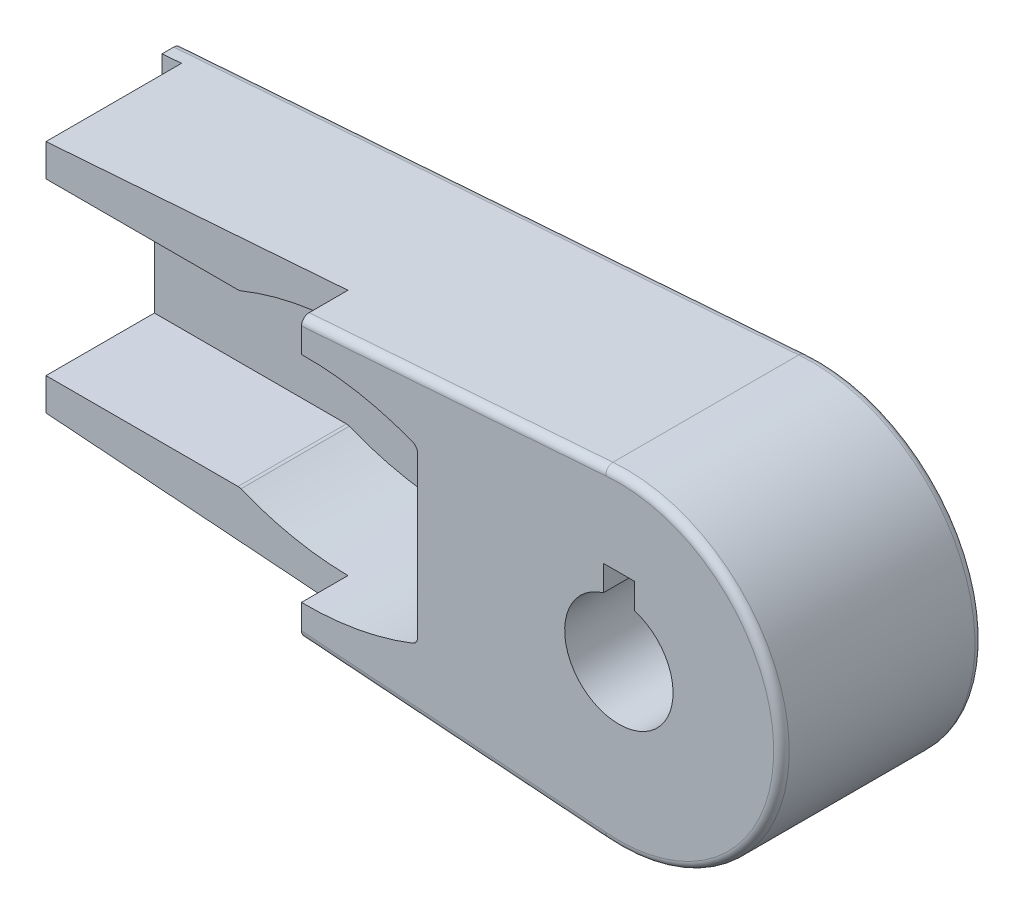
ISO-10303-21;
HEADER;
FILE_DESCRIPTION(('STEP AP214'),'2;1');
FILE_NAME('part.step','',(''),(''),'','','');
FILE_SCHEMA(('AUTOMOTIVE_DESIGN { 1 0 10303 214 1 1 1 1 }'));
ENDSEC;
DATA;
#1=APPLICATION_CONTEXT('core data for automotive mechanical design processes');
#2=APPLICATION_PROTOCOL_DEFINITION('international standard','automotive_design',2000,#1);
#3=PRODUCT_CONTEXT('',#1,'mechanical');
#4=PRODUCT('Part','Part','',(#3));
#5=PRODUCT_RELATED_PRODUCT_CATEGORY('part','',(#4));
#6=PRODUCT_DEFINITION_FORMATION('','',#4);
#7=PRODUCT_DEFINITION_CONTEXT('part definition',#1,'design');
#8=PRODUCT_DEFINITION('design','',#6,#7);
#9=PRODUCT_DEFINITION_SHAPE('','',#8);
#10=(LENGTH_UNIT() NAMED_UNIT(*) SI_UNIT(.MILLI.,.METRE.));
#11=(NAMED_UNIT(*) PLANE_ANGLE_UNIT() SI_UNIT($,.RADIAN.));
#12=(NAMED_UNIT(*) SI_UNIT($,.STERADIAN.) SOLID_ANGLE_UNIT());
#13=UNCERTAINTY_MEASURE_WITH_UNIT(LENGTH_MEASURE(1.E-05),#10,'distance_accuracy_value','');
#14=(GEOMETRIC_REPRESENTATION_CONTEXT(3) GLOBAL_UNCERTAINTY_ASSIGNED_CONTEXT((#13)) GLOBAL_UNIT_ASSIGNED_CONTEXT((#10,
#11,#12)) REPRESENTATION_CONTEXT('',''));
#15=CARTESIAN_POINT('',(0.,0.,0.));
#16=DIRECTION('',(0.,0.,1.));
#17=DIRECTION('',(1.,0.,0.));
#18=AXIS2_PLACEMENT_3D('',#15,#16,#17);
#19=CARTESIAN_POINT('',(-165.,-22.,-40.));
#20=DIRECTION('',(0.,-1.,0.));
#21=DIRECTION('',(0.,0.,-1.));
#22=AXIS2_PLACEMENT_3D('',#19,#20,#21);
#23=PLANE('',#22);
#24=DIRECTION('',(-1.,0.,0.));
#25=VECTOR('',#24,1.);
#26=CARTESIAN_POINT('',(-165.,-22.,-12.));
#27=LINE('',#26,#25);
#28=CARTESIAN_POINT('',(-110.393907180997,-22.,-12.));
#29=VERTEX_POINT('',#28);
#30=CARTESIAN_POINT('',(-160.,-22.,-12.));
#31=VERTEX_POINT('',#30);
#32=EDGE_CURVE('E267',#29,#31,#27,.T.);
#33=ORIENTED_EDGE('',*,*,#32,.F.);
#34=DIRECTION('',(0.,0.,1.));
#35=VECTOR('',#34,1.);
#36=CARTESIAN_POINT('',(-110.393907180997,-22.,-40.));
#37=LINE('',#36,#35);
#38=CARTESIAN_POINT('',(-110.393907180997,-22.,-40.));
#39=VERTEX_POINT('',#38);
#40=EDGE_CURVE('E413',#29,#39,#37,.F.);
#41=ORIENTED_EDGE('',*,*,#40,.T.);
#42=DIRECTION('',(1.,0.,0.));
#43=VECTOR('',#42,1.);
#44=CARTESIAN_POINT('',(-165.,-22.,-40.));
#45=LINE('',#44,#43);
#46=CARTESIAN_POINT('',(-160.,-22.,-40.));
#47=VERTEX_POINT('',#46);
#48=EDGE_CURVE('E471',#47,#39,#45,.T.);
#49=ORIENTED_EDGE('',*,*,#48,.F.);
#50=DIRECTION('',(0.,0.,-1.));
#51=VECTOR('',#50,1.);
#52=CARTESIAN_POINT('',(-160.,-22.,-40.));
#53=LINE('',#52,#51);
#54=EDGE_CURVE('E400',#31,#47,#53,.T.);
#55=ORIENTED_EDGE('',*,*,#54,.F.);
#56=EDGE_LOOP('',(#33,#41,#49,#55));
#57=FACE_BOUND('',#56,.T.);
#58=ADVANCED_FACE('F31',(#57),#23,.F.);
#59=CARTESIAN_POINT('',(-165.,22.,-40.));
#60=DIRECTION('',(0.,1.,0.));
#61=DIRECTION('',(0.,0.,1.));
#62=AXIS2_PLACEMENT_3D('',#59,#60,#61);
#63=PLANE('',#62);
#64=DIRECTION('',(-1.,0.,0.));
#65=VECTOR('',#64,1.);
#66=CARTESIAN_POINT('',(-165.,22.,-40.));
#67=LINE('',#66,#65);
#68=CARTESIAN_POINT('',(-110.393907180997,22.,-40.));
#69=VERTEX_POINT('',#68);
#70=CARTESIAN_POINT('',(-160.,22.,-40.));
#71=VERTEX_POINT('',#70);
#72=EDGE_CURVE('E469',#69,#71,#67,.T.);
#73=ORIENTED_EDGE('',*,*,#72,.F.);
#74=DIRECTION('',(0.,0.,1.));
#75=VECTOR('',#74,1.);
#76=CARTESIAN_POINT('',(-110.393907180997,22.,-40.));
#77=LINE('',#76,#75);
#78=CARTESIAN_POINT('',(-110.393907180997,22.,-12.));
#79=VERTEX_POINT('',#78);
#80=EDGE_CURVE('E440',#69,#79,#77,.T.);
#81=ORIENTED_EDGE('',*,*,#80,.T.);
#82=DIRECTION('',(1.,0.,0.));
#83=VECTOR('',#82,1.);
#84=CARTESIAN_POINT('',(-165.,22.,-12.));
#85=LINE('',#84,#83);
#86=CARTESIAN_POINT('',(-160.,22.,-12.));
#87=VERTEX_POINT('',#86);
#88=EDGE_CURVE('E265',#87,#79,#85,.T.);
#89=ORIENTED_EDGE('',*,*,#88,.F.);
#90=DIRECTION('',(0.,0.,1.));
#91=VECTOR('',#90,1.);
#92=CARTESIAN_POINT('',(-160.,22.,-40.));
#93=LINE('',#92,#91);
#94=EDGE_CURVE('E227',#71,#87,#93,.T.);
#95=ORIENTED_EDGE('',*,*,#94,.F.);
#96=EDGE_LOOP('',(#73,#81,#89,#95));
#97=FACE_BOUND('',#96,.T.);
#98=ADVANCED_FACE('F347',(#97),#63,.F.);
#99=CARTESIAN_POINT('',(-81.,48.2495551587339,-40.));
#100=DIRECTION('',(0.,0.,-1.));
#101=DIRECTION('',(-1.,0.,0.));
#102=AXIS2_PLACEMENT_3D('',#99,#100,#101);
#103=PLANE('',#102);
#104=CARTESIAN_POINT('',(-81.,48.2495551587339,-40.));
#105=DIRECTION('',(0.,0.,1.));
#106=DIRECTION('',(-1.,0.,0.));
#107=AXIS2_PLACEMENT_3D('',#104,#105,#106);
#108=CIRCLE('',#107,76.);
#109=CARTESIAN_POINT('',(-109.640217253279,-22.1474473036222,-40.));
#110=VERTEX_POINT('',#109);
#111=CARTESIAN_POINT('',(-53.2702702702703,-22.5110418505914,-40.));
#112=VERTEX_POINT('',#111);
#113=EDGE_CURVE('E473',#110,#112,#108,.T.);
#114=ORIENTED_EDGE('',*,*,#113,.T.);
#115=CARTESIAN_POINT('',(-54.0000000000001,-20.6489208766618,-40.));
#116=DIRECTION('',(0.,0.,-1.));
#117=DIRECTION('',(-1.,0.,0.));
#118=AXIS2_PLACEMENT_3D('',#115,#116,#117);
#119=CIRCLE('',#118,2.);
#120=CARTESIAN_POINT('',(-52.,-20.6489208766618,-40.));
#121=VERTEX_POINT('',#120);
#122=EDGE_CURVE('E433',#112,#121,#119,.F.);
#123=ORIENTED_EDGE('',*,*,#122,.T.);
#124=DIRECTION('',(0.,1.,0.));
#125=VECTOR('',#124,1.);
#126=CARTESIAN_POINT('',(-52.,22.,-40.));
#127=LINE('',#126,#125);
#128=CARTESIAN_POINT('',(-52.,20.6489208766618,-40.));
#129=VERTEX_POINT('',#128);
#130=EDGE_CURVE('E468',#121,#129,#127,.T.);
#131=ORIENTED_EDGE('',*,*,#130,.T.);
#132=CARTESIAN_POINT('',(-54.,20.6489208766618,-40.));
#133=DIRECTION('',(0.,0.,-1.));
#134=DIRECTION('',(-1.,0.,0.));
#135=AXIS2_PLACEMENT_3D('',#132,#133,#134);
#136=CIRCLE('',#135,2.);
#137=CARTESIAN_POINT('',(-53.2702702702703,22.5110418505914,-40.));
#138=VERTEX_POINT('',#137);
#139=EDGE_CURVE('E431',#129,#138,#136,.F.);
#140=ORIENTED_EDGE('',*,*,#139,.T.);
#141=CARTESIAN_POINT('',(-81.,-48.2495551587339,-40.));
#142=DIRECTION('',(0.,0.,1.));
#143=DIRECTION('',(1.,0.,0.));
#144=AXIS2_PLACEMENT_3D('',#141,#142,#143);
#145=CIRCLE('',#144,76.);
#146=CARTESIAN_POINT('',(-109.640217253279,22.1474473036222,-40.));
#147=VERTEX_POINT('',#146);
#148=EDGE_CURVE('E466',#138,#147,#145,.T.);
#149=ORIENTED_EDGE('',*,*,#148,.T.);
#150=CARTESIAN_POINT('',(-110.393907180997,24.,-40.));
#151=DIRECTION('',(0.,0.,-1.));
#152=DIRECTION('',(-1.,0.,0.));
#153=AXIS2_PLACEMENT_3D('',#150,#151,#152);
#154=CIRCLE('',#153,2.);
#155=EDGE_CURVE('E11',#147,#69,#154,.T.);
#156=ORIENTED_EDGE('',*,*,#155,.T.);
#157=ORIENTED_EDGE('',*,*,#72,.T.);
#158=DIRECTION('',(0.,1.,0.));
#159=VECTOR('',#158,1.);
#160=CARTESIAN_POINT('',(-160.,48.2495551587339,-40.));
#161=LINE('',#160,#159);
#162=EDGE_CURVE('E226',#47,#71,#161,.T.);
#163=ORIENTED_EDGE('',*,*,#162,.F.);
#164=ORIENTED_EDGE('',*,*,#48,.T.);
#165=CARTESIAN_POINT('',(-110.393907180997,-24.,-40.));
#166=DIRECTION('',(0.,0.,-1.));
#167=DIRECTION('',(-1.,0.,0.));
#168=AXIS2_PLACEMENT_3D('',#165,#166,#167);
#169=CIRCLE('',#168,2.);
#170=EDGE_CURVE('E420',#39,#110,#169,.T.);
#171=ORIENTED_EDGE('',*,*,#170,.T.);
#172=EDGE_LOOP('',(#114,#123,#131,#140,#149,#156,#157,#163,#164,#171));
#173=FACE_BOUND('',#172,.T.);
#174=ADVANCED_FACE('F343',(#173),#103,.F.);
#175=CARTESIAN_POINT('',(-163.075800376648,-59.2019774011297,-12.));
#176=DIRECTION('',(0.,0.,1.));
#177=DIRECTION('',(1.,0.,0.));
#178=AXIS2_PLACEMENT_3D('',#175,#176,#177);
#179=PLANE('',#178);
#180=CARTESIAN_POINT('',(-81.,48.2495551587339,-12.));
#181=DIRECTION('',(0.,0.,1.));
#182=DIRECTION('',(1.,0.,0.));
#183=AXIS2_PLACEMENT_3D('',#180,#181,#182);
#184=CIRCLE('',#183,76.);
#185=CARTESIAN_POINT('',(-82.,-27.7438656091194,-12.));
#186=VERTEX_POINT('',#185);
#187=CARTESIAN_POINT('',(-109.640217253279,-22.1474473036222,-12.));
#188=VERTEX_POINT('',#187);
#189=EDGE_CURVE('E269',#186,#188,#184,.F.);
#190=ORIENTED_EDGE('',*,*,#189,.T.);
#191=CARTESIAN_POINT('',(-110.393907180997,-24.,-12.));
#192=DIRECTION('',(0.,0.,1.));
#193=DIRECTION('',(1.,0.,0.));
#194=AXIS2_PLACEMENT_3D('',#191,#192,#193);
#195=CIRCLE('',#194,2.);
#196=EDGE_CURVE('E410',#188,#29,#195,.T.);
#197=ORIENTED_EDGE('',*,*,#196,.T.);
#198=ORIENTED_EDGE('',*,*,#32,.T.);
#199=DIRECTION('',(0.,-1.,0.));
#200=VECTOR('',#199,1.);
#201=CARTESIAN_POINT('',(-160.,-59.2019774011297,-12.));
#202=LINE('',#201,#200);
#203=CARTESIAN_POINT('',(-160.,-30.3669851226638,-12.));
#204=VERTEX_POINT('',#203);
#205=EDGE_CURVE('E402',#31,#204,#202,.T.);
#206=ORIENTED_EDGE('',*,*,#205,.T.);
#207=DIRECTION('',(-0.997317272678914,0.0732001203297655,0.));
#208=VECTOR('',#207,1.);
#209=CARTESIAN_POINT('',(-165.,-30.,-12.));
#210=LINE('',#209,#208);
#211=CARTESIAN_POINT('',(-82.,-36.0919530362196,-12.));
#212=VERTEX_POINT('',#211);
#213=EDGE_CURVE('E272',#212,#204,#210,.T.);
#214=ORIENTED_EDGE('',*,*,#213,.F.);
#215=DIRECTION('',(0.,1.,0.));
#216=VECTOR('',#215,1.);
#217=CARTESIAN_POINT('',(-82.,52.7824858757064,-12.));
#218=LINE('',#217,#216);
#219=EDGE_CURVE('E251',#212,#186,#218,.T.);
#220=ORIENTED_EDGE('',*,*,#219,.T.);
#221=EDGE_LOOP('',(#190,#197,#198,#206,#214,#220));
#222=FACE_BOUND('',#221,.T.);
#223=ADVANCED_FACE('F346',(#222),#179,.T.);
#224=ORIENTED_EDGE('',*,*,#88,.T.);
#225=CARTESIAN_POINT('',(-110.393907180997,24.,-12.));
#226=DIRECTION('',(0.,0.,1.));
#227=DIRECTION('',(1.,0.,0.));
#228=AXIS2_PLACEMENT_3D('',#225,#226,#227);
#229=CIRCLE('',#228,2.);
#230=CARTESIAN_POINT('',(-109.640217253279,22.1474473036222,-12.));
#231=VERTEX_POINT('',#230);
#232=EDGE_CURVE('E46',#79,#231,#229,.T.);
#233=ORIENTED_EDGE('',*,*,#232,.T.);
#234=CARTESIAN_POINT('',(-81.,-48.2495551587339,-12.));
#235=DIRECTION('',(0.,0.,1.));
#236=DIRECTION('',(1.,0.,0.));
#237=AXIS2_PLACEMENT_3D('',#234,#235,#236);
#238=CIRCLE('',#237,76.);
#239=CARTESIAN_POINT('',(-82.,27.7438656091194,-12.));
#240=VERTEX_POINT('',#239);
#241=EDGE_CURVE('E528',#231,#240,#238,.F.);
#242=ORIENTED_EDGE('',*,*,#241,.T.);
#243=CARTESIAN_POINT('',(-82.,36.0919530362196,-12.));
#244=VERTEX_POINT('',#243);
#245=EDGE_CURVE('E248',#240,#244,#218,.T.);
#246=ORIENTED_EDGE('',*,*,#245,.T.);
#247=DIRECTION('',(0.997317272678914,0.0732001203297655,0.));
#248=VECTOR('',#247,1.);
#249=CARTESIAN_POINT('',(-165.,30.,-12.));
#250=LINE('',#249,#248);
#251=CARTESIAN_POINT('',(-160.,30.3669851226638,-12.));
#252=VERTEX_POINT('',#251);
#253=EDGE_CURVE('E275',#252,#244,#250,.T.);
#254=ORIENTED_EDGE('',*,*,#253,.F.);
#255=DIRECTION('',(0.,-1.,0.));
#256=VECTOR('',#255,1.);
#257=CARTESIAN_POINT('',(-160.,-59.2019774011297,-12.));
#258=LINE('',#257,#256);
#259=EDGE_CURVE('E222',#252,#87,#258,.T.);
#260=ORIENTED_EDGE('',*,*,#259,.T.);
#261=EDGE_LOOP('',(#224,#233,#242,#246,#254,#260));
#262=FACE_BOUND('',#261,.T.);
#263=ADVANCED_FACE('F554',(#262),#179,.T.);
#264=CARTESIAN_POINT('',(-165.,30.,-52.));
#265=DIRECTION('',(-0.0732001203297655,0.997317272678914,0.));
#266=DIRECTION('',(-0.997317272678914,-0.0732001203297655,0.));
#267=AXIS2_PLACEMENT_3D('',#264,#265,#266);
#268=PLANE('',#267);
#269=DIRECTION('',(-0.997317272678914,-0.0732001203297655,0.));
#270=VECTOR('',#269,1.);
#271=CARTESIAN_POINT('',(-165.,30.,-47.));
#272=LINE('',#271,#270);
#273=CARTESIAN_POINT('',(-160.,30.3669851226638,-47.));
#274=VERTEX_POINT('',#273);
#275=CARTESIAN_POINT('',(-165.,30.,-47.));
#276=VERTEX_POINT('',#275);
#277=EDGE_CURVE('E231',#274,#276,#272,.T.);
#278=ORIENTED_EDGE('',*,*,#277,.F.);
#279=DIRECTION('',(0.,0.,1.));
#280=VECTOR('',#279,1.);
#281=CARTESIAN_POINT('',(-160.,30.3669851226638,-52.));
#282=LINE('',#281,#280);
#283=EDGE_CURVE('E215',#274,#252,#282,.T.);
#284=ORIENTED_EDGE('',*,*,#283,.T.);
#285=ORIENTED_EDGE('',*,*,#253,.T.);
#286=DIRECTION('',(0.,0.,-1.));
#287=VECTOR('',#286,1.);
#288=CARTESIAN_POINT('',(-82.,36.0919530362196,-52.));
#289=LINE('',#288,#287);
#290=CARTESIAN_POINT('',(-82.,36.0919530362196,-2.));
#291=VERTEX_POINT('',#290);
#292=EDGE_CURVE('E256',#291,#244,#289,.T.);
#293=ORIENTED_EDGE('',*,*,#292,.F.);
#294=DIRECTION('',(-0.997317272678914,-0.0732001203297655,0.));
#295=VECTOR('',#294,1.);
#296=CARTESIAN_POINT('',(-165.,30.,-2.));
#297=LINE('',#296,#295);
#298=CARTESIAN_POINT('',(-3.52775646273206,41.8515822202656,-2.00000000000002));
#299=VERTEX_POINT('',#298);
#300=EDGE_CURVE('E515',#291,#299,#297,.F.);
#301=ORIENTED_EDGE('',*,*,#300,.T.);
#302=DIRECTION('',(0.,0.,1.));
#303=VECTOR('',#302,1.);
#304=CARTESIAN_POINT('',(-3.52775646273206,41.8515822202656,-52.));
#305=LINE('',#304,#303);
#306=CARTESIAN_POINT('',(-3.52775646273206,41.8515822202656,-50.));
#307=VERTEX_POINT('',#306);
#308=EDGE_CURVE('E487',#307,#299,#305,.T.);
#309=ORIENTED_EDGE('',*,*,#308,.F.);
#310=DIRECTION('',(-0.997317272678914,-0.0732001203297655,0.));
#311=VECTOR('',#310,1.);
#312=CARTESIAN_POINT('',(-165.,30.,-50.));
#313=LINE('',#312,#311);
#314=CARTESIAN_POINT('',(-165.,30.,-50.));
#315=VERTEX_POINT('',#314);
#316=EDGE_CURVE('E517',#307,#315,#313,.T.);
#317=ORIENTED_EDGE('',*,*,#316,.T.);
#318=DIRECTION('',(0.,0.,1.));
#319=VECTOR('',#318,1.);
#320=CARTESIAN_POINT('',(-165.,30.,-52.));
#321=LINE('',#320,#319);
#322=EDGE_CURVE('E239',#315,#276,#321,.T.);
#323=ORIENTED_EDGE('',*,*,#322,.T.);
#324=EDGE_LOOP('',(#278,#284,#285,#293,#301,#309,#317,#323));
#325=FACE_BOUND('',#324,.T.);
#326=ADVANCED_FACE('F33',(#325),#268,.T.);
#327=CARTESIAN_POINT('',(0.,0.,-52.));
#328=DIRECTION('',(0.,0.,1.));
#329=DIRECTION('',(1.,0.,0.));
#330=AXIS2_PLACEMENT_3D('',#327,#328,#329);
#331=CYLINDRICAL_SURFACE('',#330,42.);
#332=DIRECTION('',(0.,0.,1.));
#333=VECTOR('',#332,1.);
#334=CARTESIAN_POINT('',(-3.52775646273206,-41.8515822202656,-52.));
#335=LINE('',#334,#333);
#336=CARTESIAN_POINT('',(-3.52775646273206,-41.8515822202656,-50.));
#337=VERTEX_POINT('',#336);
#338=CARTESIAN_POINT('',(-3.52775646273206,-41.8515822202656,-2.00000000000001));
#339=VERTEX_POINT('',#338);
#340=EDGE_CURVE('E491',#337,#339,#335,.T.);
#341=ORIENTED_EDGE('',*,*,#340,.F.);
#342=CARTESIAN_POINT('',(0.,0.,-50.));
#343=DIRECTION('',(0.,0.,1.));
#344=DIRECTION('',(1.,0.,0.));
#345=AXIS2_PLACEMENT_3D('',#342,#343,#344);
#346=CIRCLE('',#345,42.);
#347=EDGE_CURVE('E513',#337,#307,#346,.T.);
#348=ORIENTED_EDGE('',*,*,#347,.T.);
#349=ORIENTED_EDGE('',*,*,#308,.T.);
#350=CARTESIAN_POINT('',(0.,0.,-2.));
#351=DIRECTION('',(0.,0.,1.));
#352=DIRECTION('',(1.,0.,0.));
#353=AXIS2_PLACEMENT_3D('',#350,#351,#352);
#354=CIRCLE('',#353,42.);
#355=EDGE_CURVE('E511',#299,#339,#354,.F.);
#356=ORIENTED_EDGE('',*,*,#355,.T.);
#357=EDGE_LOOP('',(#341,#348,#349,#356));
#358=FACE_BOUND('',#357,.T.);
#359=ADVANCED_FACE('F379',(#358),#331,.T.);
#360=CARTESIAN_POINT('',(-165.,-30.,-52.));
#361=DIRECTION('',(-0.0732001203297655,-0.997317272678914,0.));
#362=DIRECTION('',(0.997317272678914,-0.0732001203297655,0.));
#363=AXIS2_PLACEMENT_3D('',#360,#361,#362);
#364=PLANE('',#363);
#365=DIRECTION('',(0.997317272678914,-0.0732001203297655,0.));
#366=VECTOR('',#365,1.);
#367=CARTESIAN_POINT('',(-165.,-30.,-47.));
#368=LINE('',#367,#366);
#369=CARTESIAN_POINT('',(-165.,-30.,-47.));
#370=VERTEX_POINT('',#369);
#371=CARTESIAN_POINT('',(-160.,-30.3669851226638,-47.));
#372=VERTEX_POINT('',#371);
#373=EDGE_CURVE('E234',#370,#372,#368,.T.);
#374=ORIENTED_EDGE('',*,*,#373,.F.);
#375=DIRECTION('',(0.,0.,1.));
#376=VECTOR('',#375,1.);
#377=CARTESIAN_POINT('',(-165.,-30.,-52.));
#378=LINE('',#377,#376);
#379=CARTESIAN_POINT('',(-165.,-30.,-50.));
#380=VERTEX_POINT('',#379);
#381=EDGE_CURVE('E394',#380,#370,#378,.T.);
#382=ORIENTED_EDGE('',*,*,#381,.F.);
#383=DIRECTION('',(0.997317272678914,-0.0732001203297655,0.));
#384=VECTOR('',#383,1.);
#385=CARTESIAN_POINT('',(-3.527756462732,-41.8515822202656,-50.));
#386=LINE('',#385,#384);
#387=EDGE_CURVE('E498',#380,#337,#386,.T.);
#388=ORIENTED_EDGE('',*,*,#387,.T.);
#389=ORIENTED_EDGE('',*,*,#340,.T.);
#390=DIRECTION('',(0.997317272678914,-0.0732001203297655,0.));
#391=VECTOR('',#390,1.);
#392=CARTESIAN_POINT('',(-165.,-30.,-2.));
#393=LINE('',#392,#391);
#394=CARTESIAN_POINT('',(-82.,-36.0919530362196,-2.));
#395=VERTEX_POINT('',#394);
#396=EDGE_CURVE('E490',#339,#395,#393,.F.);
#397=ORIENTED_EDGE('',*,*,#396,.T.);
#398=DIRECTION('',(0.,0.,1.));
#399=VECTOR('',#398,1.);
#400=CARTESIAN_POINT('',(-82.,-36.0919530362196,-52.));
#401=LINE('',#400,#399);
#402=EDGE_CURVE('E252',#212,#395,#401,.T.);
#403=ORIENTED_EDGE('',*,*,#402,.F.);
#404=ORIENTED_EDGE('',*,*,#213,.T.);
#405=DIRECTION('',(0.,0.,-1.));
#406=VECTOR('',#405,1.);
#407=CARTESIAN_POINT('',(-160.,-30.3669851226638,-52.));
#408=LINE('',#407,#406);
#409=EDGE_CURVE('E244',#204,#372,#408,.T.);
#410=ORIENTED_EDGE('',*,*,#409,.T.);
#411=EDGE_LOOP('',(#374,#382,#388,#389,#397,#403,#404,#410));
#412=FACE_BOUND('',#411,.T.);
#413=ADVANCED_FACE('F382',(#412),#364,.T.);
#414=CARTESIAN_POINT('',(-165.,30.,-52.));
#415=DIRECTION('',(-1.,0.,0.));
#416=DIRECTION('',(0.,0.,1.));
#417=AXIS2_PLACEMENT_3D('',#414,#415,#416);
#418=PLANE('',#417);
#419=DIRECTION('',(0.,-1.,0.));
#420=VECTOR('',#419,1.);
#421=CARTESIAN_POINT('',(-165.,34.8022598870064,-47.));
#422=LINE('',#421,#420);
#423=EDGE_CURVE('E235',#276,#370,#422,.T.);
#424=ORIENTED_EDGE('',*,*,#423,.F.);
#425=ORIENTED_EDGE('',*,*,#322,.F.);
#426=CARTESIAN_POINT('',(-165.,27.9946201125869,-50.));
#427=DIRECTION('',(-1.,0.,0.));
#428=DIRECTION('',(0.,1.,0.));
#429=AXIS2_PLACEMENT_3D('',#426,#427,#428);
#430=ELLIPSE('',#429,2.00537988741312,2.);
#431=CARTESIAN_POINT('',(-165.,27.9946201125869,-52.));
#432=VERTEX_POINT('',#431);
#433=EDGE_CURVE('E507',#315,#432,#430,.T.);
#434=ORIENTED_EDGE('',*,*,#433,.T.);
#435=DIRECTION('',(0.,-1.,0.));
#436=VECTOR('',#435,1.);
#437=CARTESIAN_POINT('',(-165.,30.,-52.));
#438=LINE('',#437,#436);
#439=CARTESIAN_POINT('',(-165.,-27.9946201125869,-52.));
#440=VERTEX_POINT('',#439);
#441=EDGE_CURVE('E484',#432,#440,#438,.T.);
#442=ORIENTED_EDGE('',*,*,#441,.T.);
#443=CARTESIAN_POINT('',(-165.,-27.9946201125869,-50.));
#444=DIRECTION('',(-1.,0.,0.));
#445=DIRECTION('',(0.,1.,0.));
#446=AXIS2_PLACEMENT_3D('',#443,#444,#445);
#447=ELLIPSE('',#446,2.00537988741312,2.);
#448=EDGE_CURVE('E509',#440,#380,#447,.T.);
#449=ORIENTED_EDGE('',*,*,#448,.T.);
#450=ORIENTED_EDGE('',*,*,#381,.T.);
#451=EDGE_LOOP('',(#424,#425,#434,#442,#449,#450));
#452=FACE_BOUND('',#451,.T.);
#453=ADVANCED_FACE('F377',(#452),#418,.T.);
#454=CARTESIAN_POINT('',(0.,0.,-52.));
#455=DIRECTION('',(0.,0.,1.));
#456=DIRECTION('',(1.,0.,0.));
#457=AXIS2_PLACEMENT_3D('',#454,#455,#456);
#458=PLANE('',#457);
#459=DIRECTION('',(-1.,0.,0.));
#460=VECTOR('',#459,1.);
#461=CARTESIAN_POINT('',(-4.,20.,-52.));
#462=LINE('',#461,#460);
#463=CARTESIAN_POINT('',(4.,20.,-52.));
#464=VERTEX_POINT('',#463);
#465=CARTESIAN_POINT('',(-4.,20.,-52.));
#466=VERTEX_POINT('',#465);
#467=EDGE_CURVE('E572',#464,#466,#462,.T.);
#468=ORIENTED_EDGE('',*,*,#467,.T.);
#469=DIRECTION('',(0.,-1.,0.));
#470=VECTOR('',#469,1.);
#471=CARTESIAN_POINT('',(-4.,13.4164078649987,-52.));
#472=LINE('',#471,#470);
#473=CARTESIAN_POINT('',(-4.,13.4164078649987,-52.));
#474=VERTEX_POINT('',#473);
#475=EDGE_CURVE('E564',#466,#474,#472,.T.);
#476=ORIENTED_EDGE('',*,*,#475,.T.);
#477=CARTESIAN_POINT('',(0.,0.,-52.));
#478=DIRECTION('',(0.,0.,1.));
#479=DIRECTION('',(1.,0.,0.));
#480=AXIS2_PLACEMENT_3D('',#477,#478,#479);
#481=CIRCLE('',#480,14.);
#482=CARTESIAN_POINT('',(4.,13.4164078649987,-52.));
#483=VERTEX_POINT('',#482);
#484=EDGE_CURVE('E481',#474,#483,#481,.T.);
#485=ORIENTED_EDGE('',*,*,#484,.T.);
#486=DIRECTION('',(0.,1.,0.));
#487=VECTOR('',#486,1.);
#488=CARTESIAN_POINT('',(4.,20.,-52.));
#489=LINE('',#488,#487);
#490=EDGE_CURVE('E575',#483,#464,#489,.T.);
#491=ORIENTED_EDGE('',*,*,#490,.T.);
#492=EDGE_LOOP('',(#468,#476,#485,#491));
#493=FACE_BOUND('',#492,.T.);
#494=CARTESIAN_POINT('',(0.,0.,-52.));
#495=DIRECTION('',(0.,0.,1.));
#496=DIRECTION('',(1.,0.,0.));
#497=AXIS2_PLACEMENT_3D('',#494,#495,#496);
#498=CIRCLE('',#497,40.);
#499=CARTESIAN_POINT('',(-3.37042581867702,39.857749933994,-52.));
#500=VERTEX_POINT('',#499);
#501=CARTESIAN_POINT('',(-3.37042581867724,-39.8577499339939,-52.));
#502=VERTEX_POINT('',#501);
#503=EDGE_CURVE('E503',#500,#502,#498,.F.);
#504=ORIENTED_EDGE('',*,*,#503,.T.);
#505=DIRECTION('',(0.997317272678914,-0.0732001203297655,0.));
#506=VECTOR('',#505,1.);
#507=CARTESIAN_POINT('',(-164.85359975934,-28.0053654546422,-52.));
#508=LINE('',#507,#506);
#509=EDGE_CURVE('E505',#502,#440,#508,.F.);
#510=ORIENTED_EDGE('',*,*,#509,.T.);
#511=ORIENTED_EDGE('',*,*,#441,.F.);
#512=DIRECTION('',(-0.997317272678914,-0.0732001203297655,0.));
#513=VECTOR('',#512,1.);
#514=CARTESIAN_POINT('',(-3.38135622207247,39.8569476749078,-52.));
#515=LINE('',#514,#513);
#516=EDGE_CURVE('E501',#432,#500,#515,.F.);
#517=ORIENTED_EDGE('',*,*,#516,.T.);
#518=EDGE_LOOP('',(#504,#510,#511,#517));
#519=FACE_BOUND('',#518,.T.);
#520=ADVANCED_FACE('F373',(#493,#519),#458,.F.);
#521=CARTESIAN_POINT('',(0.,0.,0.));
#522=DIRECTION('',(0.,0.,1.));
#523=DIRECTION('',(1.,0.,0.));
#524=AXIS2_PLACEMENT_3D('',#521,#522,#523);
#525=PLANE('',#524);
#526=DIRECTION('',(0.,1.,0.));
#527=VECTOR('',#526,1.);
#528=CARTESIAN_POINT('',(-82.,52.7824858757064,0.));
#529=LINE('',#528,#527);
#530=CARTESIAN_POINT('',(-82.,-34.0865731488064,0.));
#531=VERTEX_POINT('',#530);
#532=CARTESIAN_POINT('',(-82.,-27.7438656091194,0.));
#533=VERTEX_POINT('',#532);
#534=EDGE_CURVE('E242',#531,#533,#529,.T.);
#535=ORIENTED_EDGE('',*,*,#534,.F.);
#536=DIRECTION('',(0.997317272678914,-0.0732001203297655,0.));
#537=VECTOR('',#536,1.);
#538=CARTESIAN_POINT('',(-2.92782459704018,-39.8902355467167,0.));
#539=LINE('',#538,#537);
#540=CARTESIAN_POINT('',(-3.3704258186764,-39.857749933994,0.));
#541=VERTEX_POINT('',#540);
#542=EDGE_CURVE('E524',#531,#541,#539,.T.);
#543=ORIENTED_EDGE('',*,*,#542,.T.);
#544=CARTESIAN_POINT('',(0.,0.,0.));
#545=DIRECTION('',(0.,0.,1.));
#546=DIRECTION('',(1.,0.,0.));
#547=AXIS2_PLACEMENT_3D('',#544,#545,#546);
#548=CIRCLE('',#547,40.);
#549=CARTESIAN_POINT('',(-3.37042581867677,39.857749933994,0.));
#550=VERTEX_POINT('',#549);
#551=EDGE_CURVE('E522',#541,#550,#548,.T.);
#552=ORIENTED_EDGE('',*,*,#551,.T.);
#553=DIRECTION('',(-0.997317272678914,-0.0732001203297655,0.));
#554=VECTOR('',#553,1.);
#555=CARTESIAN_POINT('',(-2.92782459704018,39.8902355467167,0.));
#556=LINE('',#555,#554);
#557=CARTESIAN_POINT('',(-82.0000000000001,34.0865731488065,0.));
#558=VERTEX_POINT('',#557);
#559=EDGE_CURVE('E519',#550,#558,#556,.T.);
#560=ORIENTED_EDGE('',*,*,#559,.T.);
#561=CARTESIAN_POINT('',(-82.,27.7438656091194,0.));
#562=VERTEX_POINT('',#561);
#563=EDGE_CURVE('E240',#562,#558,#529,.T.);
#564=ORIENTED_EDGE('',*,*,#563,.F.);
#565=CARTESIAN_POINT('',(-81.,-48.2495551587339,0.));
#566=DIRECTION('',(0.,0.,1.));
#567=DIRECTION('',(1.,0.,0.));
#568=AXIS2_PLACEMENT_3D('',#565,#566,#567);
#569=CIRCLE('',#568,76.);
#570=CARTESIAN_POINT('',(-53.2702702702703,22.5110418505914,0.));
#571=VERTEX_POINT('',#570);
#572=EDGE_CURVE('E452',#571,#562,#569,.T.);
#573=ORIENTED_EDGE('',*,*,#572,.F.);
#574=CARTESIAN_POINT('',(-54.,20.6489208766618,0.));
#575=DIRECTION('',(0.,0.,1.));
#576=DIRECTION('',(1.,0.,0.));
#577=AXIS2_PLACEMENT_3D('',#574,#575,#576);
#578=CIRCLE('',#577,2.);
#579=CARTESIAN_POINT('',(-52.,20.6489208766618,0.));
#580=VERTEX_POINT('',#579);
#581=EDGE_CURVE('E39',#571,#580,#578,.F.);
#582=ORIENTED_EDGE('',*,*,#581,.T.);
#583=DIRECTION('',(0.,1.,0.));
#584=VECTOR('',#583,1.);
#585=CARTESIAN_POINT('',(-52.,22.,0.));
#586=LINE('',#585,#584);
#587=CARTESIAN_POINT('',(-52.,-20.6489208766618,0.));
#588=VERTEX_POINT('',#587);
#589=EDGE_CURVE('E450',#588,#580,#586,.T.);
#590=ORIENTED_EDGE('',*,*,#589,.F.);
#591=CARTESIAN_POINT('',(-54.0000000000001,-20.6489208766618,0.));
#592=DIRECTION('',(0.,0.,1.));
#593=DIRECTION('',(1.,0.,0.));
#594=AXIS2_PLACEMENT_3D('',#591,#592,#593);
#595=CIRCLE('',#594,2.);
#596=CARTESIAN_POINT('',(-53.2702702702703,-22.5110418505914,0.));
#597=VERTEX_POINT('',#596);
#598=EDGE_CURVE('E444',#588,#597,#595,.F.);
#599=ORIENTED_EDGE('',*,*,#598,.T.);
#600=CARTESIAN_POINT('',(-81.,48.2495551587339,0.));
#601=DIRECTION('',(0.,0.,1.));
#602=DIRECTION('',(-1.,0.,0.));
#603=AXIS2_PLACEMENT_3D('',#600,#601,#602);
#604=CIRCLE('',#603,76.);
#605=EDGE_CURVE('E459',#533,#597,#604,.T.);
#606=ORIENTED_EDGE('',*,*,#605,.F.);
#607=EDGE_LOOP('',(#535,#543,#552,#560,#564,#573,#582,#590,#599,#606));
#608=FACE_BOUND('',#607,.T.);
#609=DIRECTION('',(0.,-1.,0.));
#610=VECTOR('',#609,1.);
#611=CARTESIAN_POINT('',(-4.,13.4164078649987,0.));
#612=LINE('',#611,#610);
#613=CARTESIAN_POINT('',(-4.,20.,0.));
#614=VERTEX_POINT('',#613);
#615=CARTESIAN_POINT('',(-4.,13.4164078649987,0.));
#616=VERTEX_POINT('',#615);
#617=EDGE_CURVE('E578',#614,#616,#612,.T.);
#618=ORIENTED_EDGE('',*,*,#617,.F.);
#619=DIRECTION('',(-1.,0.,0.));
#620=VECTOR('',#619,1.);
#621=CARTESIAN_POINT('',(-4.,20.,0.));
#622=LINE('',#621,#620);
#623=CARTESIAN_POINT('',(4.,20.,0.));
#624=VERTEX_POINT('',#623);
#625=EDGE_CURVE('E579',#624,#614,#622,.T.);
#626=ORIENTED_EDGE('',*,*,#625,.F.);
#627=DIRECTION('',(0.,1.,0.));
#628=VECTOR('',#627,1.);
#629=CARTESIAN_POINT('',(4.,20.,0.));
#630=LINE('',#629,#628);
#631=CARTESIAN_POINT('',(4.,13.4164078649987,0.));
#632=VERTEX_POINT('',#631);
#633=EDGE_CURVE('E323',#632,#624,#630,.T.);
#634=ORIENTED_EDGE('',*,*,#633,.F.);
#635=CARTESIAN_POINT('',(0.,0.,0.));
#636=DIRECTION('',(0.,0.,1.));
#637=DIRECTION('',(1.,0.,0.));
#638=AXIS2_PLACEMENT_3D('',#635,#636,#637);
#639=CIRCLE('',#638,14.);
#640=EDGE_CURVE('E478',#616,#632,#639,.T.);
#641=ORIENTED_EDGE('',*,*,#640,.F.);
#642=EDGE_LOOP('',(#618,#626,#634,#641));
#643=FACE_BOUND('',#642,.T.);
#644=ADVANCED_FACE('F369',(#608,#643),#525,.T.);
#645=CARTESIAN_POINT('',(0.,0.,-52.));
#646=DIRECTION('',(0.,0.,1.));
#647=DIRECTION('',(1.,0.,0.));
#648=AXIS2_PLACEMENT_3D('',#645,#646,#647);
#649=CYLINDRICAL_SURFACE('',#648,14.);
#650=ORIENTED_EDGE('',*,*,#484,.F.);
#651=DIRECTION('',(0.,0.,1.));
#652=VECTOR('',#651,1.);
#653=CARTESIAN_POINT('',(-4.,13.4164078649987,-52.));
#654=LINE('',#653,#652);
#655=EDGE_CURVE('E560',#474,#616,#654,.T.);
#656=ORIENTED_EDGE('',*,*,#655,.T.);
#657=ORIENTED_EDGE('',*,*,#640,.T.);
#658=DIRECTION('',(0.,0.,1.));
#659=VECTOR('',#658,1.);
#660=CARTESIAN_POINT('',(4.,13.4164078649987,-52.));
#661=LINE('',#660,#659);
#662=EDGE_CURVE('E561',#483,#632,#661,.T.);
#663=ORIENTED_EDGE('',*,*,#662,.F.);
#664=EDGE_LOOP('',(#650,#656,#657,#663));
#665=FACE_BOUND('',#664,.T.);
#666=ADVANCED_FACE('F365',(#665),#649,.F.);
#667=CARTESIAN_POINT('',(-81.,48.2495551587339,-40.));
#668=DIRECTION('',(0.,0.,1.));
#669=DIRECTION('',(1.,0.,0.));
#670=AXIS2_PLACEMENT_3D('',#667,#668,#669);
#671=CYLINDRICAL_SURFACE('',#670,76.);
#672=ORIENTED_EDGE('',*,*,#113,.F.);
#673=DIRECTION('',(0.,0.,1.));
#674=VECTOR('',#673,1.);
#675=CARTESIAN_POINT('',(-109.640217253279,-22.1474473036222,-40.));
#676=LINE('',#675,#674);
#677=EDGE_CURVE('E425',#110,#188,#676,.T.);
#678=ORIENTED_EDGE('',*,*,#677,.T.);
#679=ORIENTED_EDGE('',*,*,#189,.F.);
#680=DIRECTION('',(0.,0.,1.));
#681=VECTOR('',#680,1.);
#682=CARTESIAN_POINT('',(-82.,-27.7438656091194,-40.));
#683=LINE('',#682,#681);
#684=EDGE_CURVE('E262',#186,#533,#683,.T.);
#685=ORIENTED_EDGE('',*,*,#684,.T.);
#686=ORIENTED_EDGE('',*,*,#605,.T.);
#687=DIRECTION('',(0.,0.,1.));
#688=VECTOR('',#687,1.);
#689=CARTESIAN_POINT('',(-53.2702702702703,-22.5110418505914,-40.));
#690=LINE('',#689,#688);
#691=EDGE_CURVE('E531',#597,#112,#690,.F.);
#692=ORIENTED_EDGE('',*,*,#691,.T.);
#693=EDGE_LOOP('',(#672,#678,#679,#685,#686,#692));
#694=FACE_BOUND('',#693,.T.);
#695=ADVANCED_FACE('F358',(#694),#671,.F.);
#696=CARTESIAN_POINT('',(-81.,-48.2495551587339,-40.));
#697=DIRECTION('',(0.,0.,1.));
#698=DIRECTION('',(1.,0.,0.));
#699=AXIS2_PLACEMENT_3D('',#696,#697,#698);
#700=CYLINDRICAL_SURFACE('',#699,76.);
#701=ORIENTED_EDGE('',*,*,#148,.F.);
#702=DIRECTION('',(0.,0.,1.));
#703=VECTOR('',#702,1.);
#704=CARTESIAN_POINT('',(-53.2702702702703,22.5110418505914,-40.));
#705=LINE('',#704,#703);
#706=EDGE_CURVE('E437',#138,#571,#705,.T.);
#707=ORIENTED_EDGE('',*,*,#706,.T.);
#708=ORIENTED_EDGE('',*,*,#572,.T.);
#709=DIRECTION('',(0.,0.,1.));
#710=VECTOR('',#709,1.);
#711=CARTESIAN_POINT('',(-82.,27.7438656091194,-40.));
#712=LINE('',#711,#710);
#713=EDGE_CURVE('E259',#562,#240,#712,.F.);
#714=ORIENTED_EDGE('',*,*,#713,.T.);
#715=ORIENTED_EDGE('',*,*,#241,.F.);
#716=DIRECTION('',(0.,0.,1.));
#717=VECTOR('',#716,1.);
#718=CARTESIAN_POINT('',(-109.640217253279,22.1474473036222,-40.));
#719=LINE('',#718,#717);
#720=EDGE_CURVE('E435',#231,#147,#719,.F.);
#721=ORIENTED_EDGE('',*,*,#720,.T.);
#722=EDGE_LOOP('',(#701,#707,#708,#714,#715,#721));
#723=FACE_BOUND('',#722,.T.);
#724=ADVANCED_FACE('F355',(#723),#700,.F.);
#725=CARTESIAN_POINT('',(-52.,22.,-40.));
#726=DIRECTION('',(1.,0.,0.));
#727=DIRECTION('',(0.,1.,0.));
#728=AXIS2_PLACEMENT_3D('',#725,#726,#727);
#729=PLANE('',#728);
#730=ORIENTED_EDGE('',*,*,#130,.F.);
#731=DIRECTION('',(0.,0.,-1.));
#732=VECTOR('',#731,1.);
#733=CARTESIAN_POINT('',(-52.,-20.6489208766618,0.));
#734=LINE('',#733,#732);
#735=EDGE_CURVE('E423',#121,#588,#734,.F.);
#736=ORIENTED_EDGE('',*,*,#735,.T.);
#737=ORIENTED_EDGE('',*,*,#589,.T.);
#738=DIRECTION('',(0.,0.,-1.));
#739=VECTOR('',#738,1.);
#740=CARTESIAN_POINT('',(-52.,20.6489208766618,-40.));
#741=LINE('',#740,#739);
#742=EDGE_CURVE('E421',#580,#129,#741,.T.);
#743=ORIENTED_EDGE('',*,*,#742,.T.);
#744=EDGE_LOOP('',(#730,#736,#737,#743));
#745=FACE_BOUND('',#744,.T.);
#746=ADVANCED_FACE('F335',(#745),#729,.F.);
#747=CARTESIAN_POINT('',(-4.,13.4164078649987,-52.));
#748=DIRECTION('',(-1.,0.,0.));
#749=DIRECTION('',(0.,0.,1.));
#750=AXIS2_PLACEMENT_3D('',#747,#748,#749);
#751=PLANE('',#750);
#752=ORIENTED_EDGE('',*,*,#617,.T.);
#753=ORIENTED_EDGE('',*,*,#655,.F.);
#754=ORIENTED_EDGE('',*,*,#475,.F.);
#755=DIRECTION('',(0.,0.,1.));
#756=VECTOR('',#755,1.);
#757=CARTESIAN_POINT('',(-4.,20.,-52.));
#758=LINE('',#757,#756);
#759=EDGE_CURVE('E566',#466,#614,#758,.T.);
#760=ORIENTED_EDGE('',*,*,#759,.T.);
#761=EDGE_LOOP('',(#752,#753,#754,#760));
#762=FACE_BOUND('',#761,.T.);
#763=ADVANCED_FACE('F331',(#762),#751,.F.);
#764=CARTESIAN_POINT('',(-4.,20.,-52.));
#765=DIRECTION('',(0.,1.,0.));
#766=DIRECTION('',(0.,0.,1.));
#767=AXIS2_PLACEMENT_3D('',#764,#765,#766);
#768=PLANE('',#767);
#769=ORIENTED_EDGE('',*,*,#625,.T.);
#770=ORIENTED_EDGE('',*,*,#759,.F.);
#771=ORIENTED_EDGE('',*,*,#467,.F.);
#772=DIRECTION('',(0.,0.,1.));
#773=VECTOR('',#772,1.);
#774=CARTESIAN_POINT('',(4.,20.,-52.));
#775=LINE('',#774,#773);
#776=EDGE_CURVE('E563',#464,#624,#775,.T.);
#777=ORIENTED_EDGE('',*,*,#776,.T.);
#778=EDGE_LOOP('',(#769,#770,#771,#777));
#779=FACE_BOUND('',#778,.T.);
#780=ADVANCED_FACE('F334',(#779),#768,.F.);
#781=CARTESIAN_POINT('',(4.,20.,-52.));
#782=DIRECTION('',(1.,0.,0.));
#783=DIRECTION('',(0.,1.,0.));
#784=AXIS2_PLACEMENT_3D('',#781,#782,#783);
#785=PLANE('',#784);
#786=ORIENTED_EDGE('',*,*,#633,.T.);
#787=ORIENTED_EDGE('',*,*,#776,.F.);
#788=ORIENTED_EDGE('',*,*,#490,.F.);
#789=ORIENTED_EDGE('',*,*,#662,.T.);
#790=EDGE_LOOP('',(#786,#787,#788,#789));
#791=FACE_BOUND('',#790,.T.);
#792=ADVANCED_FACE('F329',(#791),#785,.F.);
#793=CARTESIAN_POINT('',(-164.85359975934,28.0053654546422,-50.));
#794=DIRECTION('',(0.997317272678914,0.0732001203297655,0.));
#795=DIRECTION('',(-0.0732001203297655,0.997317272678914,0.));
#796=AXIS2_PLACEMENT_3D('',#793,#794,#795);
#797=CYLINDRICAL_SURFACE('',#796,2.);
#798=ORIENTED_EDGE('',*,*,#433,.F.);
#799=ORIENTED_EDGE('',*,*,#316,.F.);
#800=CARTESIAN_POINT('',(-3.52775646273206,41.8515822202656,-50.));
#801=CARTESIAN_POINT('',(-3.52775643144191,41.8515818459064,-50.0562667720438));
#802=CARTESIAN_POINT('',(-3.52756971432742,41.8492135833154,-50.112506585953));
#803=CARTESIAN_POINT('',(-3.52682481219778,41.8397656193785,-50.2245838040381));
#804=CARTESIAN_POINT('',(-3.5262666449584,41.8326861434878,-50.2804212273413));
#805=CARTESIAN_POINT('',(-3.5240401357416,41.8044467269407,-50.4466406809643));
#806=CARTESIAN_POINT('',(-3.52181977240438,41.7762856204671,-50.5559092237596));
#807=CARTESIAN_POINT('',(-3.51596834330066,41.7020755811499,-50.7681495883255));
#808=CARTESIAN_POINT('',(-3.5123365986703,41.6560180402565,-50.8711183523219));
#809=CARTESIAN_POINT('',(-3.50376575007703,41.547331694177,-51.067826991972));
#810=CARTESIAN_POINT('',(-3.49882697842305,41.4847071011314,-51.1615692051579));
#811=CARTESIAN_POINT('',(-3.48778186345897,41.344666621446,-51.3371679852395));
#812=CARTESIAN_POINT('',(-3.48167560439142,41.2672518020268,-51.4190254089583));
#813=CARTESIAN_POINT('',(-3.46846474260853,41.0997844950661,-51.5685768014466));
#814=CARTESIAN_POINT('',(-3.46135973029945,41.0097268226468,-51.6362649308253));
#815=CARTESIAN_POINT('',(-3.44635281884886,40.8195353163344,-51.7555344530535));
#816=CARTESIAN_POINT('',(-3.43845058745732,40.7193972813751,-51.8071090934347));
#817=CARTESIAN_POINT('',(-3.42207996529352,40.511975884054,-51.8926038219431));
#818=CARTESIAN_POINT('',(-3.41361227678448,40.4047013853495,-51.9265453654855));
#819=CARTESIAN_POINT('',(-3.40040599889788,40.2374196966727,-51.9643147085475));
#820=CARTESIAN_POINT('',(-3.39577985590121,40.1788255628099,-51.9748005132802));
#821=CARTESIAN_POINT('',(-3.38647548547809,40.0609868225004,-51.9904725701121));
#822=CARTESIAN_POINT('',(-3.38179732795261,40.0017430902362,-51.9956652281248));
#823=CARTESIAN_POINT('',(-3.37488374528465,39.9141970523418,-51.9993997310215));
#824=CARTESIAN_POINT('',(-3.37265458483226,39.8859704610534,-52.0000016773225));
#825=CARTESIAN_POINT('',(-3.37042581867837,39.8577499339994,-52.));
#826=B_SPLINE_CURVE_WITH_KNOTS('',3,(#800,#801,#802,#803,#804,#805,#806,#807,#808,#809,#810,
#811,#812,#813,#814,#815,#816,#817,#818,#819,#820,#821,#822,#823,#824,#825),.UNSPECIFIED.,.F.,
.F.,(4,2,2,2,2,2,2,2,2,2,2,2,4),(0.,0.168696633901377,0.337385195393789,0.674231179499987,
1.01123938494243,1.34816198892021,1.68506029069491,2.02209716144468,2.35927508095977,
2.69604176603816,2.87495822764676,3.05365790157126,3.1385922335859),.UNSPECIFIED.);
#827=EDGE_CURVE('E317',#500,#307,#826,.F.);
#828=ORIENTED_EDGE('',*,*,#827,.F.);
#829=ORIENTED_EDGE('',*,*,#516,.F.);
#830=EDGE_LOOP('',(#798,#799,#828,#829));
#831=FACE_BOUND('',#830,.T.);
#832=ADVANCED_FACE('F325',(#831),#797,.T.);
#833=CARTESIAN_POINT('',(0.,0.,-50.));
#834=DIRECTION('',(0.,0.,1.));
#835=DIRECTION('',(1.,0.,0.));
#836=AXIS2_PLACEMENT_3D('',#833,#834,#835);
#837=TOROIDAL_SURFACE('',#836,40.,2.);
#838=ORIENTED_EDGE('',*,*,#827,.T.);
#839=ORIENTED_EDGE('',*,*,#347,.F.);
#840=CARTESIAN_POINT('',(-3.52775646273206,-41.8515822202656,-50.));
#841=CARTESIAN_POINT('',(-3.52775643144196,-41.8515818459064,-50.0562667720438));
#842=CARTESIAN_POINT('',(-3.52756971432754,-41.8492135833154,-50.112506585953));
#843=CARTESIAN_POINT('',(-3.52682481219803,-41.8397656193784,-50.2245838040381));
#844=CARTESIAN_POINT('',(-3.5262666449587,-41.8326861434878,-50.2804212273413));
#845=CARTESIAN_POINT('',(-3.52404013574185,-41.8044467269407,-50.4466406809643));
#846=CARTESIAN_POINT('',(-3.52181977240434,-41.7762856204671,-50.5559092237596));
#847=CARTESIAN_POINT('',(-3.51596834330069,-41.7020755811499,-50.7681495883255));
#848=CARTESIAN_POINT('',(-3.51233659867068,-41.6560180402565,-50.8711183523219));
#849=CARTESIAN_POINT('',(-3.5037657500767,-41.547331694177,-51.067826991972));
#850=CARTESIAN_POINT('',(-3.49882697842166,-41.4847071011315,-51.1615692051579));
#851=CARTESIAN_POINT('',(-3.4877818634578,-41.344666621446,-51.3371679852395));
#852=CARTESIAN_POINT('',(-3.48167560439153,-41.2672518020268,-51.4190254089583));
#853=CARTESIAN_POINT('',(-3.46846474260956,-41.099784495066,-51.5685768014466));
#854=CARTESIAN_POINT('',(-3.46135973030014,-41.0097268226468,-51.6362649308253));
#855=CARTESIAN_POINT('',(-3.44635281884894,-40.8195353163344,-51.7555344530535));
#856=CARTESIAN_POINT('',(-3.43845058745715,-40.7193972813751,-51.8071090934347));
#857=CARTESIAN_POINT('',(-3.42207996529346,-40.511975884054,-51.8926038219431));
#858=CARTESIAN_POINT('',(-3.41361227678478,-40.4047013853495,-51.9265453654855));
#859=CARTESIAN_POINT('',(-3.40040599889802,-40.2374196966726,-51.9643147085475));
#860=CARTESIAN_POINT('',(-3.39577985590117,-40.1788255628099,-51.9748005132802));
#861=CARTESIAN_POINT('',(-3.38647548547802,-40.0609868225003,-51.9904725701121));
#862=CARTESIAN_POINT('',(-3.38179732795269,-40.0017430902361,-51.9956652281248));
#863=CARTESIAN_POINT('',(-3.37488374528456,-39.9141970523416,-51.9993997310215));
#864=CARTESIAN_POINT('',(-3.37265458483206,-39.8859704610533,-52.0000016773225));
#865=CARTESIAN_POINT('',(-3.37042581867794,-39.8577499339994,-52.));
#866=B_SPLINE_CURVE_WITH_KNOTS('',3,(#840,#841,#842,#843,#844,#845,#846,#847,#848,#849,#850,
#851,#852,#853,#854,#855,#856,#857,#858,#859,#860,#861,#862,#863,#864,#865),.UNSPECIFIED.,.F.,
.F.,(4,2,2,2,2,2,2,2,2,2,2,2,4),(0.,0.168696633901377,0.337385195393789,0.674231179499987,
1.01123938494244,1.34816198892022,1.68506029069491,2.02209716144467,2.35927508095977,
2.69604176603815,2.87495822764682,3.0536579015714,3.138592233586),.UNSPECIFIED.);
#867=EDGE_CURVE('E312',#502,#337,#866,.F.);
#868=ORIENTED_EDGE('',*,*,#867,.F.);
#869=ORIENTED_EDGE('',*,*,#503,.F.);
#870=EDGE_LOOP('',(#838,#839,#868,#869));
#871=FACE_BOUND('',#870,.T.);
#872=ADVANCED_FACE('F308',(#871),#837,.T.);
#873=CARTESIAN_POINT('',(-164.85359975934,-28.0053654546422,-50.));
#874=DIRECTION('',(-0.997317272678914,0.0732001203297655,0.));
#875=DIRECTION('',(-0.0732001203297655,-0.997317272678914,0.));
#876=AXIS2_PLACEMENT_3D('',#873,#874,#875);
#877=CYLINDRICAL_SURFACE('',#876,2.);
#878=ORIENTED_EDGE('',*,*,#448,.F.);
#879=ORIENTED_EDGE('',*,*,#509,.F.);
#880=ORIENTED_EDGE('',*,*,#867,.T.);
#881=ORIENTED_EDGE('',*,*,#387,.F.);
#882=EDGE_LOOP('',(#878,#879,#880,#881));
#883=FACE_BOUND('',#882,.T.);
#884=ADVANCED_FACE('F303',(#883),#877,.T.);
#885=CARTESIAN_POINT('',(-2.92782459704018,39.8902355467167,-2.));
#886=DIRECTION('',(-0.997317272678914,-0.0732001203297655,0.));
#887=DIRECTION('',(0.0732001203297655,-0.997317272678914,0.));
#888=AXIS2_PLACEMENT_3D('',#885,#886,#887);
#889=CYLINDRICAL_SURFACE('',#888,2.);
#890=CARTESIAN_POINT('',(-82.,34.0865731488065,-2.));
#891=DIRECTION('',(1.,0.,0.));
#892=DIRECTION('',(0.,-1.,0.));
#893=AXIS2_PLACEMENT_3D('',#890,#891,#892);
#894=ELLIPSE('',#893,2.00537988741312,2.);
#895=EDGE_CURVE('E254',#558,#291,#894,.F.);
#896=ORIENTED_EDGE('',*,*,#895,.F.);
#897=ORIENTED_EDGE('',*,*,#559,.F.);
#898=CARTESIAN_POINT('',(-3.52775646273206,41.8515822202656,-2.));
#899=CARTESIAN_POINT('',(-3.52775643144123,41.8515818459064,-1.94373322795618));
#900=CARTESIAN_POINT('',(-3.52756971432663,41.8492135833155,-1.88749341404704));
#901=CARTESIAN_POINT('',(-3.5268248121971,41.8397656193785,-1.77541619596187));
#902=CARTESIAN_POINT('',(-3.52626664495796,41.8326861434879,-1.71957877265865));
#903=CARTESIAN_POINT('',(-3.52404013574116,41.8044467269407,-1.55335931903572));
#904=CARTESIAN_POINT('',(-3.521819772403,41.7762856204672,-1.44409077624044));
#905=CARTESIAN_POINT('',(-3.515968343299,41.7020755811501,-1.23185041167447));
#906=CARTESIAN_POINT('',(-3.51233659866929,41.6560180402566,-1.1288816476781));
#907=CARTESIAN_POINT('',(-3.5037657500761,41.547331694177,-0.932173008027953));
#908=CARTESIAN_POINT('',(-3.49882697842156,41.4847071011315,-0.838430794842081));
#909=CARTESIAN_POINT('',(-3.48778186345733,41.3446666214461,-0.662832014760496));
#910=CARTESIAN_POINT('',(-3.48167560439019,41.2672518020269,-0.580974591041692));
#911=CARTESIAN_POINT('',(-3.46846474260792,41.0997844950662,-0.431423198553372));
#912=CARTESIAN_POINT('',(-3.46135973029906,41.0097268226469,-0.363735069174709));
#913=CARTESIAN_POINT('',(-3.44635281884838,40.8195353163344,-0.24446554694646));
#914=CARTESIAN_POINT('',(-3.43845058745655,40.7193972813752,-0.192890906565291));
#915=CARTESIAN_POINT('',(-3.42207996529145,40.5119758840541,-0.107396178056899));
#916=CARTESIAN_POINT('',(-3.4136122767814,40.4047013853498,-0.0734546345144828));
#917=CARTESIAN_POINT('',(-3.40040599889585,40.2374196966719,-0.0356852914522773));
#918=CARTESIAN_POINT('',(-3.3957798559,40.1788255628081,-0.0251994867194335));
#919=CARTESIAN_POINT('',(-3.38647548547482,40.0609868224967,-0.00952742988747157));
#920=CARTESIAN_POINT('',(-3.38179732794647,40.0017430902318,-0.00433477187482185));
#921=CARTESIAN_POINT('',(-3.37488374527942,39.9141970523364,-0.000600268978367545));
#922=CARTESIAN_POINT('',(-3.37265458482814,39.885970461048,1.67732254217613E-06));
#923=CARTESIAN_POINT('',(-3.3704258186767,39.857749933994,0.));
#924=B_SPLINE_CURVE_WITH_KNOTS('',3,(#898,#899,#900,#901,#902,#903,#904,#905,#906,#907,#908,
#909,#910,#911,#912,#913,#914,#915,#916,#917,#918,#919,#920,#921,#922,#923),.UNSPECIFIED.,.F.,
.F.,(4,2,2,2,2,2,2,2,2,2,2,2,4),(0.,0.168696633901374,0.337385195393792,0.674231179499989,
1.01123938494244,1.34816198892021,1.68506029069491,2.02209716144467,2.35927508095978,
2.69604176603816,2.87495822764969,3.05365790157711,3.13859223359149),.UNSPECIFIED.);
#925=EDGE_CURVE('E285',#299,#550,#924,.T.);
#926=ORIENTED_EDGE('',*,*,#925,.F.);
#927=ORIENTED_EDGE('',*,*,#300,.F.);
#928=EDGE_LOOP('',(#896,#897,#926,#927));
#929=FACE_BOUND('',#928,.T.);
#930=ADVANCED_FACE('F299',(#929),#889,.T.);
#931=CARTESIAN_POINT('',(0.,0.,-2.));
#932=DIRECTION('',(0.,0.,1.));
#933=DIRECTION('',(1.,0.,0.));
#934=AXIS2_PLACEMENT_3D('',#931,#932,#933);
#935=TOROIDAL_SURFACE('',#934,40.,2.);
#936=ORIENTED_EDGE('',*,*,#925,.T.);
#937=ORIENTED_EDGE('',*,*,#551,.F.);
#938=CARTESIAN_POINT('',(-3.52775646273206,-41.8515822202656,-2.));
#939=CARTESIAN_POINT('',(-3.52775643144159,-41.8515818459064,-1.94373322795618));
#940=CARTESIAN_POINT('',(-3.52756971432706,-41.8492135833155,-1.88749341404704));
#941=CARTESIAN_POINT('',(-3.52682481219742,-41.8397656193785,-1.77541619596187));
#942=CARTESIAN_POINT('',(-3.52626664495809,-41.8326861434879,-1.71957877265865));
#943=CARTESIAN_POINT('',(-3.52404013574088,-41.8044467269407,-1.55335931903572));
#944=CARTESIAN_POINT('',(-3.52181977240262,-41.7762856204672,-1.44409077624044));
#945=CARTESIAN_POINT('',(-3.5159683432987,-41.7020755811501,-1.23185041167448));
#946=CARTESIAN_POINT('',(-3.51233659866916,-41.6560180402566,-1.1288816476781));
#947=CARTESIAN_POINT('',(-3.50376575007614,-41.547331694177,-0.932173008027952));
#948=CARTESIAN_POINT('',(-3.4988269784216,-41.4847071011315,-0.838430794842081));
#949=CARTESIAN_POINT('',(-3.48778186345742,-41.3446666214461,-0.662832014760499));
#950=CARTESIAN_POINT('',(-3.48167560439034,-41.2672518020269,-0.580974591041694));
#951=CARTESIAN_POINT('',(-3.46846474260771,-41.0997844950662,-0.431423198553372));
#952=CARTESIAN_POINT('',(-3.46135973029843,-41.0097268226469,-0.363735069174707));
#953=CARTESIAN_POINT('',(-3.44635281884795,-40.8195353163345,-0.244465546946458));
#954=CARTESIAN_POINT('',(-3.43845058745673,-40.7193972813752,-0.19289090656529));
#955=CARTESIAN_POINT('',(-3.42207996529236,-40.5119758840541,-0.1073961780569));
#956=CARTESIAN_POINT('',(-3.41361227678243,-40.4047013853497,-0.0734546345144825));
#957=CARTESIAN_POINT('',(-3.40040599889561,-40.2374196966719,-0.0356852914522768));
#958=CARTESIAN_POINT('',(-3.39577985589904,-40.1788255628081,-0.025199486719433));
#959=CARTESIAN_POINT('',(-3.3864754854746,-40.0609868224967,-0.00952742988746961));
#960=CARTESIAN_POINT('',(-3.38179732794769,-40.0017430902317,-0.00433477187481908));
#961=CARTESIAN_POINT('',(-3.37488374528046,-39.9141970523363,-0.000600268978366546));
#962=CARTESIAN_POINT('',(-3.37265458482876,-39.8859704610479,1.67732254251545E-06));
#963=CARTESIAN_POINT('',(-3.37042581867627,-39.857749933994,0.));
#964=B_SPLINE_CURVE_WITH_KNOTS('',3,(#938,#939,#940,#941,#942,#943,#944,#945,#946,#947,#948,
#949,#950,#951,#952,#953,#954,#955,#956,#957,#958,#959,#960,#961,#962,#963),.UNSPECIFIED.,.F.,
.F.,(4,2,2,2,2,2,2,2,2,2,2,2,4),(0.,0.168696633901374,0.337385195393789,0.674231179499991,
1.01123938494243,1.34816198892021,1.6850602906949,2.02209716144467,2.35927508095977,
2.69604176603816,2.8749582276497,3.05365790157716,3.13859223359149),.UNSPECIFIED.);
#965=EDGE_CURVE('E277',#339,#541,#964,.T.);
#966=ORIENTED_EDGE('',*,*,#965,.F.);
#967=ORIENTED_EDGE('',*,*,#355,.F.);
#968=EDGE_LOOP('',(#936,#937,#966,#967));
#969=FACE_BOUND('',#968,.T.);
#970=ADVANCED_FACE('F291',(#969),#935,.T.);
#971=CARTESIAN_POINT('',(-2.92782459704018,-39.8902355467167,-2.));
#972=DIRECTION('',(0.997317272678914,-0.0732001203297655,0.));
#973=DIRECTION('',(0.0732001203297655,0.997317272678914,0.));
#974=AXIS2_PLACEMENT_3D('',#971,#972,#973);
#975=CYLINDRICAL_SURFACE('',#974,2.);
#976=CARTESIAN_POINT('',(-82.,-34.0865731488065,-2.));
#977=DIRECTION('',(1.,0.,0.));
#978=DIRECTION('',(0.,-1.,0.));
#979=AXIS2_PLACEMENT_3D('',#976,#977,#978);
#980=ELLIPSE('',#979,2.00537988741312,2.);
#981=EDGE_CURVE('E526',#395,#531,#980,.F.);
#982=ORIENTED_EDGE('',*,*,#981,.F.);
#983=ORIENTED_EDGE('',*,*,#396,.F.);
#984=ORIENTED_EDGE('',*,*,#965,.T.);
#985=ORIENTED_EDGE('',*,*,#542,.F.);
#986=EDGE_LOOP('',(#982,#983,#984,#985));
#987=FACE_BOUND('',#986,.T.);
#988=ADVANCED_FACE('F294',(#987),#975,.T.);
#989=CARTESIAN_POINT('',(-82.,52.7824858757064,-12.));
#990=DIRECTION('',(1.,0.,0.));
#991=DIRECTION('',(0.,1.,0.));
#992=AXIS2_PLACEMENT_3D('',#989,#990,#991);
#993=PLANE('',#992);
#994=ORIENTED_EDGE('',*,*,#219,.F.);
#995=ORIENTED_EDGE('',*,*,#402,.T.);
#996=ORIENTED_EDGE('',*,*,#981,.T.);
#997=ORIENTED_EDGE('',*,*,#534,.T.);
#998=ORIENTED_EDGE('',*,*,#684,.F.);
#999=EDGE_LOOP('',(#994,#995,#996,#997,#998));
#1000=FACE_BOUND('',#999,.T.);
#1001=ADVANCED_FACE('F297',(#1000),#993,.F.);
#1002=ORIENTED_EDGE('',*,*,#563,.T.);
#1003=ORIENTED_EDGE('',*,*,#895,.T.);
#1004=ORIENTED_EDGE('',*,*,#292,.T.);
#1005=ORIENTED_EDGE('',*,*,#245,.F.);
#1006=ORIENTED_EDGE('',*,*,#713,.F.);
#1007=EDGE_LOOP('',(#1002,#1003,#1004,#1005,#1006));
#1008=FACE_BOUND('',#1007,.T.);
#1009=ADVANCED_FACE('F550',(#1008),#993,.F.);
#1010=CARTESIAN_POINT('',(-160.,34.8022598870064,-47.));
#1011=DIRECTION('',(0.,0.,-1.));
#1012=DIRECTION('',(0.,1.,0.));
#1013=AXIS2_PLACEMENT_3D('',#1010,#1011,#1012);
#1014=PLANE('',#1013);
#1015=ORIENTED_EDGE('',*,*,#277,.T.);
#1016=ORIENTED_EDGE('',*,*,#423,.T.);
#1017=ORIENTED_EDGE('',*,*,#373,.T.);
#1018=DIRECTION('',(0.,-1.,0.));
#1019=VECTOR('',#1018,1.);
#1020=CARTESIAN_POINT('',(-160.,34.8022598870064,-47.));
#1021=LINE('',#1020,#1019);
#1022=EDGE_CURVE('E219',#274,#372,#1021,.T.);
#1023=ORIENTED_EDGE('',*,*,#1022,.F.);
#1024=EDGE_LOOP('',(#1015,#1016,#1017,#1023));
#1025=FACE_BOUND('',#1024,.T.);
#1026=ADVANCED_FACE('F230',(#1025),#1014,.F.);
#1027=CARTESIAN_POINT('',(-160.,-32.7550681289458,-47.));
#1028=DIRECTION('',(-1.,0.,0.));
#1029=DIRECTION('',(0.,0.,1.));
#1030=AXIS2_PLACEMENT_3D('',#1027,#1028,#1029);
#1031=PLANE('',#1030);
#1032=ORIENTED_EDGE('',*,*,#205,.F.);
#1033=ORIENTED_EDGE('',*,*,#54,.T.);
#1034=ORIENTED_EDGE('',*,*,#162,.T.);
#1035=ORIENTED_EDGE('',*,*,#94,.T.);
#1036=ORIENTED_EDGE('',*,*,#259,.F.);
#1037=ORIENTED_EDGE('',*,*,#283,.F.);
#1038=ORIENTED_EDGE('',*,*,#1022,.T.);
#1039=ORIENTED_EDGE('',*,*,#409,.F.);
#1040=EDGE_LOOP('',(#1032,#1033,#1034,#1035,#1036,#1037,#1038,#1039));
#1041=FACE_BOUND('',#1040,.T.);
#1042=ADVANCED_FACE('F218',(#1041),#1031,.T.);
#1043=CARTESIAN_POINT('',(-110.393907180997,-24.,-40.));
#1044=DIRECTION('',(0.,0.,1.));
#1045=DIRECTION('',(1.,0.,0.));
#1046=AXIS2_PLACEMENT_3D('',#1043,#1044,#1045);
#1047=CYLINDRICAL_SURFACE('',#1046,2.);
#1048=ORIENTED_EDGE('',*,*,#170,.F.);
#1049=ORIENTED_EDGE('',*,*,#40,.F.);
#1050=ORIENTED_EDGE('',*,*,#196,.F.);
#1051=ORIENTED_EDGE('',*,*,#677,.F.);
#1052=EDGE_LOOP('',(#1048,#1049,#1050,#1051));
#1053=FACE_BOUND('',#1052,.T.);
#1054=ADVANCED_FACE('F417',(#1053),#1047,.T.);
#1055=CARTESIAN_POINT('',(-54.0000000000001,-20.6489208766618,-40.));
#1056=DIRECTION('',(0.,0.,1.));
#1057=DIRECTION('',(1.,0.,0.));
#1058=AXIS2_PLACEMENT_3D('',#1055,#1056,#1057);
#1059=CYLINDRICAL_SURFACE('',#1058,2.);
#1060=ORIENTED_EDGE('',*,*,#122,.F.);
#1061=ORIENTED_EDGE('',*,*,#691,.F.);
#1062=ORIENTED_EDGE('',*,*,#598,.F.);
#1063=ORIENTED_EDGE('',*,*,#735,.F.);
#1064=EDGE_LOOP('',(#1060,#1061,#1062,#1063));
#1065=FACE_BOUND('',#1064,.T.);
#1066=ADVANCED_FACE('F695',(#1065),#1059,.F.);
#1067=CARTESIAN_POINT('',(-54.,20.6489208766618,-40.));
#1068=DIRECTION('',(0.,0.,1.));
#1069=DIRECTION('',(1.,0.,0.));
#1070=AXIS2_PLACEMENT_3D('',#1067,#1068,#1069);
#1071=CYLINDRICAL_SURFACE('',#1070,2.);
#1072=ORIENTED_EDGE('',*,*,#139,.F.);
#1073=ORIENTED_EDGE('',*,*,#742,.F.);
#1074=ORIENTED_EDGE('',*,*,#581,.F.);
#1075=ORIENTED_EDGE('',*,*,#706,.F.);
#1076=EDGE_LOOP('',(#1072,#1073,#1074,#1075));
#1077=FACE_BOUND('',#1076,.T.);
#1078=ADVANCED_FACE('F462',(#1077),#1071,.F.);
#1079=CARTESIAN_POINT('',(-110.393907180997,24.,-40.));
#1080=DIRECTION('',(0.,0.,1.));
#1081=DIRECTION('',(1.,0.,0.));
#1082=AXIS2_PLACEMENT_3D('',#1079,#1080,#1081);
#1083=CYLINDRICAL_SURFACE('',#1082,2.);
#1084=ORIENTED_EDGE('',*,*,#155,.F.);
#1085=ORIENTED_EDGE('',*,*,#720,.F.);
#1086=ORIENTED_EDGE('',*,*,#232,.F.);
#1087=ORIENTED_EDGE('',*,*,#80,.F.);
#1088=EDGE_LOOP('',(#1084,#1085,#1086,#1087));
#1089=FACE_BOUND('',#1088,.T.);
#1090=ADVANCED_FACE('F710',(#1089),#1083,.T.);
#1091=CLOSED_SHELL('',(#58,#98,#174,#223,#263,#326,#359,#413,#453,#520,#644,#666,#695,#724,#746,
#763,#780,#792,#832,#872,#884,#930,#970,#988,#1001,#1009,#1026,#1042,#1054,#1066,#1078,#1090));
#1092=MANIFOLD_SOLID_BREP('B2',#1091);
#1093=ADVANCED_BREP_SHAPE_REPRESENTATION('',(#18,#1092),#14);
#1094=SHAPE_DEFINITION_REPRESENTATION(#9,#1093);
ENDSEC;
END-ISO-10303-21;
